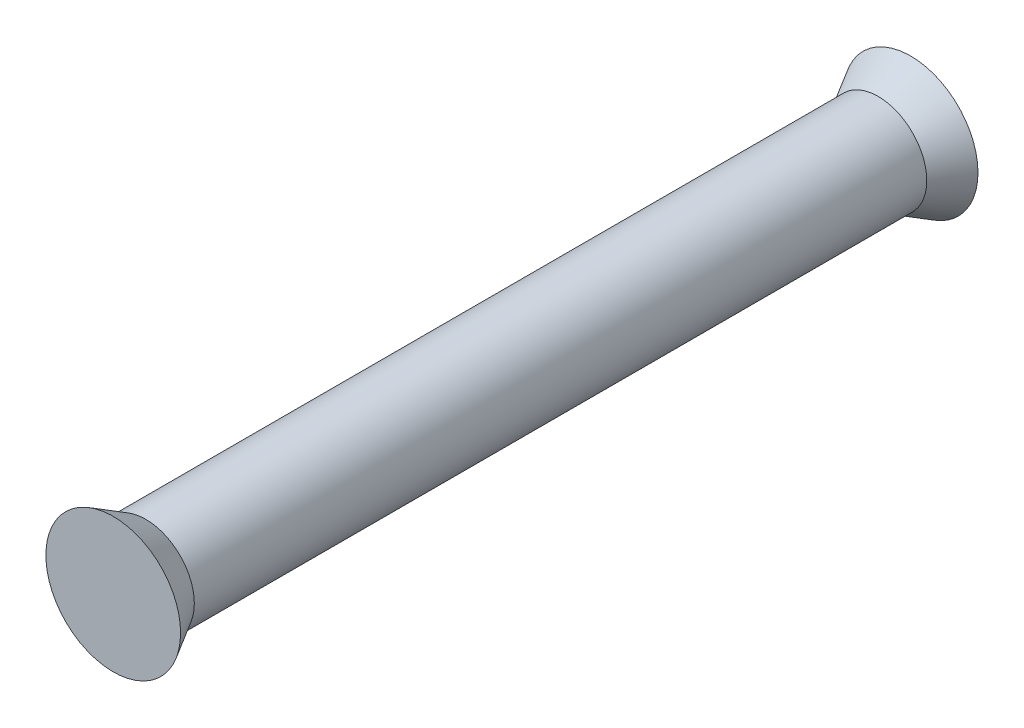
from build123d import *


with BuildPart() as part:
    # Sketch 1 → Revolve 1 (revolve)
    with BuildSketch(Plane(origin=(0, 0, 0), x_dir=(0, 0, -1), z_dir=(1, 0, 0)), mode=Mode.PRIVATE) as revolve_1_sk:
        Polygon((0, 0), (38.9636, 0), (38.9636, 3.291443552), (37.3761, 2.3749), (1.5875, 2.3749), (0, 3.291443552), align=None)
    revolve(revolve_1_sk.sketch.rotate(Axis((0, 0, 0), (0, 0, -1)), 90), axis=Axis((0, 0, 0), (0, 0, -1)))


solid = part.part
